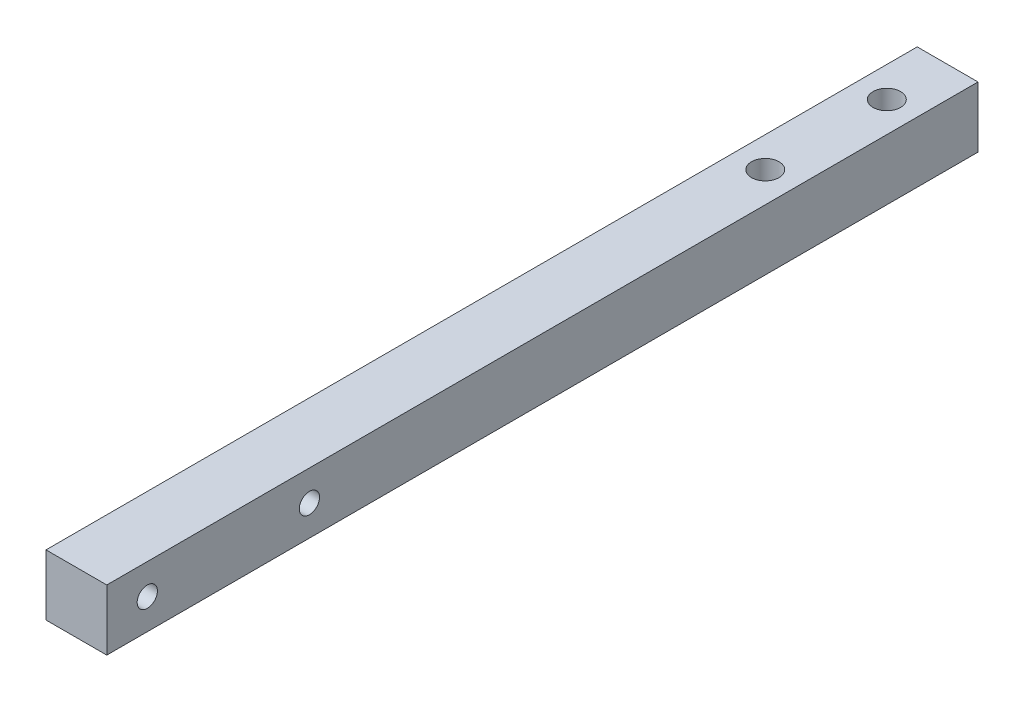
from build123d import *

# Parameters (mm, degrees)
ESQUISSE1_W       = 15
ESQUISSE1_H       = 15
EXTRUSION1_DEPTH  = 215
TROU_TARAUD_M61_D = 5
TROU_TARAUD_M81_D = 6.8


with BuildPart() as part:
    # Esquisse1 → Extrusion1 (new body)
    with BuildSketch(Plane.XY):
        with Locations((7.5, 7.5)):
            Rectangle(ESQUISSE1_W, ESQUISSE1_H)
    extrude(amount=EXTRUSION1_DEPTH)

    # Trou taraud_ M61 (through all)
    with Locations(Plane(origin=(15, 0, 0), x_dir=(0, 0, -1), z_dir=(1, 0, 0))):
        with Locations((-165, 7.5), (-205, 7.5)):
            Hole(TROU_TARAUD_M61_D / 2)

    # Trou taraud_ M81 (through all)
    with Locations(Plane(origin=(0, 15, 0), x_dir=(-1, 0, 0), z_dir=(0, 1, 0))):
        with Locations((-7.5, 45), (-7.5, 15)):
            Hole(TROU_TARAUD_M81_D / 2)


solid = part.part
